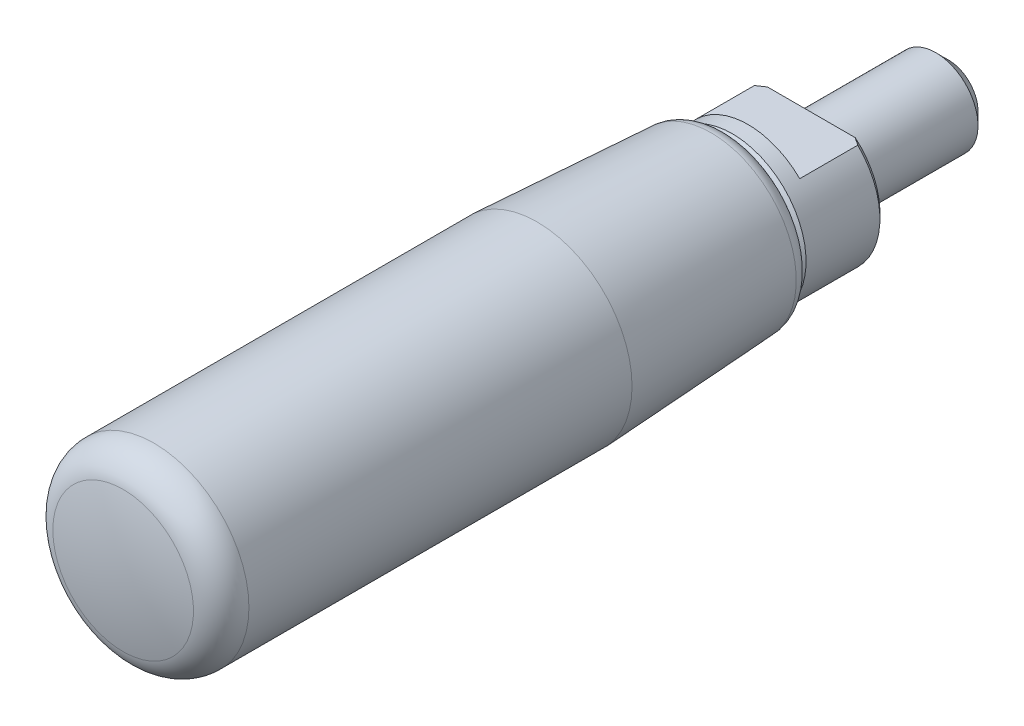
ISO-10303-21;
HEADER;
FILE_DESCRIPTION(('STEP AP214'),'2;1');
FILE_NAME('part.step','',(''),(''),'','','');
FILE_SCHEMA(('AUTOMOTIVE_DESIGN { 1 0 10303 214 1 1 1 1 }'));
ENDSEC;
DATA;
#1=APPLICATION_CONTEXT('core data for automotive mechanical design processes');
#2=APPLICATION_PROTOCOL_DEFINITION('international standard','automotive_design',2000,#1);
#3=PRODUCT_CONTEXT('',#1,'mechanical');
#4=PRODUCT('Part','Part','',(#3));
#5=PRODUCT_RELATED_PRODUCT_CATEGORY('part','',(#4));
#6=PRODUCT_DEFINITION_FORMATION('','',#4);
#7=PRODUCT_DEFINITION_CONTEXT('part definition',#1,'design');
#8=PRODUCT_DEFINITION('design','',#6,#7);
#9=PRODUCT_DEFINITION_SHAPE('','',#8);
#10=(LENGTH_UNIT() NAMED_UNIT(*) SI_UNIT(.MILLI.,.METRE.));
#11=(NAMED_UNIT(*) PLANE_ANGLE_UNIT() SI_UNIT($,.RADIAN.));
#12=(NAMED_UNIT(*) SI_UNIT($,.STERADIAN.) SOLID_ANGLE_UNIT());
#13=UNCERTAINTY_MEASURE_WITH_UNIT(LENGTH_MEASURE(1.E-05),#10,'distance_accuracy_value','');
#14=(GEOMETRIC_REPRESENTATION_CONTEXT(3) GLOBAL_UNCERTAINTY_ASSIGNED_CONTEXT((#13)) GLOBAL_UNIT_ASSIGNED_CONTEXT((#10,
#11,#12)) REPRESENTATION_CONTEXT('',''));
#15=CARTESIAN_POINT('',(0.,0.,0.));
#16=DIRECTION('',(0.,0.,1.));
#17=DIRECTION('',(1.,0.,0.));
#18=AXIS2_PLACEMENT_3D('',#15,#16,#17);
#19=CARTESIAN_POINT('',(0.,4.,0.));
#20=DIRECTION('',(0.,0.,-1.));
#21=DIRECTION('',(-1.,0.,0.));
#22=AXIS2_PLACEMENT_3D('',#19,#20,#21);
#23=PLANE('',#22);
#24=CARTESIAN_POINT('',(0.,0.,0.));
#25=DIRECTION('',(0.,0.,-1.));
#26=DIRECTION('',(-1.,0.,0.));
#27=AXIS2_PLACEMENT_3D('',#24,#25,#26);
#28=CIRCLE('',#27,3.99999999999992);
#29=CARTESIAN_POINT('',(-3.99999999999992,0.,0.));
#30=VERTEX_POINT('',#29);
#31=EDGE_CURVE('E170',#30,#30,#28,.T.);
#32=ORIENTED_EDGE('',*,*,#31,.F.);
#33=EDGE_LOOP('',(#32));
#34=FACE_BOUND('',#33,.T.);
#35=CARTESIAN_POINT('',(0.,0.,0.));
#36=DIRECTION('',(0.,0.,-1.));
#37=DIRECTION('',(-1.,0.,0.));
#38=AXIS2_PLACEMENT_3D('',#35,#36,#37);
#39=CIRCLE('',#38,6.5);
#40=CARTESIAN_POINT('',(4.153311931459,5.,0.));
#41=VERTEX_POINT('',#40);
#42=CARTESIAN_POINT('',(4.153311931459,-5.,0.));
#43=VERTEX_POINT('',#42);
#44=EDGE_CURVE('E139',#41,#43,#39,.T.);
#45=ORIENTED_EDGE('',*,*,#44,.T.);
#46=DIRECTION('',(-1.,0.,0.));
#47=VECTOR('',#46,1.);
#48=CARTESIAN_POINT('',(0.,-5.,0.));
#49=LINE('',#48,#47);
#50=CARTESIAN_POINT('',(-4.153311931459,-5.,0.));
#51=VERTEX_POINT('',#50);
#52=EDGE_CURVE('E79',#43,#51,#49,.T.);
#53=ORIENTED_EDGE('',*,*,#52,.T.);
#54=CARTESIAN_POINT('',(-4.153311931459,5.,0.));
#55=VERTEX_POINT('',#54);
#56=EDGE_CURVE('E37',#51,#55,#39,.T.);
#57=ORIENTED_EDGE('',*,*,#56,.T.);
#58=DIRECTION('',(-1.,0.,0.));
#59=VECTOR('',#58,1.);
#60=CARTESIAN_POINT('',(0.,5.,0.));
#61=LINE('',#60,#59);
#62=EDGE_CURVE('E147',#41,#55,#61,.T.);
#63=ORIENTED_EDGE('',*,*,#62,.F.);
#64=EDGE_LOOP('',(#45,#53,#57,#63));
#65=FACE_BOUND('',#64,.T.);
#66=ADVANCED_FACE('F14',(#34,#65),#23,.T.);
#67=CARTESIAN_POINT('',(0.,0.,-18.));
#68=DIRECTION('',(0.,0.,-1.));
#69=DIRECTION('',(-1.,0.,0.));
#70=AXIS2_PLACEMENT_3D('',#67,#68,#69);
#71=CYLINDRICAL_SURFACE('',#70,7.);
#72=CARTESIAN_POINT('',(0.,0.,7.5));
#73=DIRECTION('',(0.,0.,-1.));
#74=DIRECTION('',(-1.,0.,0.));
#75=AXIS2_PLACEMENT_3D('',#72,#73,#74);
#76=CIRCLE('',#75,7.);
#77=CARTESIAN_POINT('',(-6.99999999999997,0.,7.50000000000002));
#78=VERTEX_POINT('',#77);
#79=EDGE_CURVE('E153',#78,#78,#76,.T.);
#80=ORIENTED_EDGE('',*,*,#79,.T.);
#81=EDGE_LOOP('',(#80));
#82=FACE_BOUND('',#81,.T.);
#83=CARTESIAN_POINT('',(0.,0.,0.5));
#84=DIRECTION('',(0.,0.,-1.));
#85=DIRECTION('',(-1.,0.,0.));
#86=AXIS2_PLACEMENT_3D('',#83,#84,#85);
#87=CIRCLE('',#86,7.);
#88=CARTESIAN_POINT('',(-4.89897948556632,-5.,0.500000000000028));
#89=VERTEX_POINT('',#88);
#90=CARTESIAN_POINT('',(-4.89897948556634,5.,0.500000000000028));
#91=VERTEX_POINT('',#90);
#92=EDGE_CURVE('E146',#89,#91,#87,.T.);
#93=ORIENTED_EDGE('',*,*,#92,.F.);
#94=DIRECTION('',(0.,0.,-1.));
#95=VECTOR('',#94,1.);
#96=CARTESIAN_POINT('',(-4.89897948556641,-5.,-18.));
#97=LINE('',#96,#95);
#98=CARTESIAN_POINT('',(-4.89897948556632,-5.,6.));
#99=VERTEX_POINT('',#98);
#100=EDGE_CURVE('E29',#89,#99,#97,.F.);
#101=ORIENTED_EDGE('',*,*,#100,.T.);
#102=CARTESIAN_POINT('',(0.,0.,6.));
#103=DIRECTION('',(0.,0.,1.));
#104=DIRECTION('',(1.,0.,0.));
#105=AXIS2_PLACEMENT_3D('',#102,#103,#104);
#106=CIRCLE('',#105,7.);
#107=CARTESIAN_POINT('',(4.89897948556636,-5.,6.));
#108=VERTEX_POINT('',#107);
#109=EDGE_CURVE('E83',#108,#99,#106,.F.);
#110=ORIENTED_EDGE('',*,*,#109,.F.);
#111=DIRECTION('',(0.,0.,-1.));
#112=VECTOR('',#111,1.);
#113=CARTESIAN_POINT('',(4.89897948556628,-5.,-18.));
#114=LINE('',#113,#112);
#115=CARTESIAN_POINT('',(4.89897948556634,-5.,0.499999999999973));
#116=VERTEX_POINT('',#115);
#117=EDGE_CURVE('E68',#108,#116,#114,.T.);
#118=ORIENTED_EDGE('',*,*,#117,.T.);
#119=CARTESIAN_POINT('',(4.89897948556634,5.,0.499999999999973));
#120=VERTEX_POINT('',#119);
#121=EDGE_CURVE('E151',#120,#116,#87,.T.);
#122=ORIENTED_EDGE('',*,*,#121,.F.);
#123=DIRECTION('',(0.,0.,-1.));
#124=VECTOR('',#123,1.);
#125=CARTESIAN_POINT('',(4.89897948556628,5.,-18.));
#126=LINE('',#125,#124);
#127=CARTESIAN_POINT('',(4.89897948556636,5.,6.));
#128=VERTEX_POINT('',#127);
#129=EDGE_CURVE('E144',#128,#120,#126,.T.);
#130=ORIENTED_EDGE('',*,*,#129,.F.);
#131=CARTESIAN_POINT('',(0.,0.,6.));
#132=DIRECTION('',(0.,0.,-1.));
#133=DIRECTION('',(-1.,0.,0.));
#134=AXIS2_PLACEMENT_3D('',#131,#132,#133);
#135=CIRCLE('',#134,7.);
#136=CARTESIAN_POINT('',(-4.89897948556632,5.,6.));
#137=VERTEX_POINT('',#136);
#138=EDGE_CURVE('E132',#128,#137,#135,.F.);
#139=ORIENTED_EDGE('',*,*,#138,.T.);
#140=DIRECTION('',(0.,0.,-1.));
#141=VECTOR('',#140,1.);
#142=CARTESIAN_POINT('',(-4.89897948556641,5.,-18.));
#143=LINE('',#142,#141);
#144=EDGE_CURVE('E235',#91,#137,#143,.F.);
#145=ORIENTED_EDGE('',*,*,#144,.F.);
#146=EDGE_LOOP('',(#93,#101,#110,#118,#122,#130,#139,#145));
#147=FACE_BOUND('',#146,.T.);
#148=ADVANCED_FACE('F86',(#82,#147),#71,.T.);
#149=CARTESIAN_POINT('',(0.,0.,0.5));
#150=DIRECTION('',(0.,0.,1.));
#151=DIRECTION('',(1.,0.,0.));
#152=AXIS2_PLACEMENT_3D('',#149,#150,#151);
#153=CONICAL_SURFACE('',#152,7.,0.785398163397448);
#154=CARTESIAN_POINT('',(1.49778965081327,-5.,-1.28048145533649));
#155=CARTESIAN_POINT('',(1.60827267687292,-5.,-1.24877770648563));
#156=CARTESIAN_POINT('',(1.71786188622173,-5.,-1.21411111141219));
#157=CARTESIAN_POINT('',(1.93517681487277,-5.,-1.13954248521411));
#158=CARTESIAN_POINT('',(2.04290360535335,-5.,-1.09964358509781));
#159=CARTESIAN_POINT('',(2.3627038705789,-5.,-0.973334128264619));
#160=CARTESIAN_POINT('',(2.57208839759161,-5.,-0.880104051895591));
#161=CARTESIAN_POINT('',(2.98262386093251,-5.,-0.680716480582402));
#162=CARTESIAN_POINT('',(3.18382286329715,-5.,-0.574655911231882));
#163=CARTESIAN_POINT('',(3.58066863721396,-5.,-0.352301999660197));
#164=CARTESIAN_POINT('',(3.77631038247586,-5.,-0.235999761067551));
#165=CARTESIAN_POINT('',(4.23337122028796,-5.,0.0481768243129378));
#166=CARTESIAN_POINT('',(4.49271359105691,-5.,0.219371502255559));
#167=CARTESIAN_POINT('',(5.00450249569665,-5.,0.571825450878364));
#168=CARTESIAN_POINT('',(5.25694692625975,-5.,0.753087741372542));
#169=CARTESIAN_POINT('',(5.75669387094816,-5.,1.1230772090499));
#170=CARTESIAN_POINT('',(6.00399063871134,-5.,1.31181211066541));
#171=CARTESIAN_POINT('',(6.49435370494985,-5.,1.69470566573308));
#172=CARTESIAN_POINT('',(6.73741975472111,-5.,1.88886463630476));
#173=CARTESIAN_POINT('',(7.22537920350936,-5.,2.28552752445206));
#174=CARTESIAN_POINT('',(7.47019951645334,-5.,2.4881211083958));
#175=CARTESIAN_POINT('',(7.95704754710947,-5.,2.89665389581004));
#176=CARTESIAN_POINT('',(8.19907512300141,-5.,3.10259326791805));
#177=CARTESIAN_POINT('',(8.67999186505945,-5.,3.51634917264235));
#178=CARTESIAN_POINT('',(8.91888922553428,-5.,3.72415619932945));
#179=CARTESIAN_POINT('',(9.39479436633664,-5.,4.14186897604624));
#180=CARTESIAN_POINT('',(9.63180236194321,-5.,4.35177448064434));
#181=CARTESIAN_POINT('',(9.8680730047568,-5.,4.5624981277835));
#182=B_SPLINE_CURVE_WITH_KNOTS('',3,(#154,#155,#156,#157,#158,#159,#160,#161,#162,#163,#164,
#165,#166,#167,#168,#169,#170,#171,#172,#173,#174,#175,#176,#177,#178,#179,#180,#181),
.UNSPECIFIED.,.F.,.F.,(4,2,2,2,2,2,2,2,2,2,2,2,2,4),(0.,0.344718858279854,0.68923237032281,
1.37610320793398,2.05807600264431,2.74064714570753,3.67254340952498,4.60472072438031,
5.53788816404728,6.47111027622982,7.42439848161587,8.37773488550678,9.32761684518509,
10.2773889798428),.UNSPECIFIED.);
#183=EDGE_CURVE('E73',#43,#116,#182,.T.);
#184=ORIENTED_EDGE('',*,*,#183,.F.);
#185=ORIENTED_EDGE('',*,*,#44,.F.);
#186=CARTESIAN_POINT('',(1.49778965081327,5.,-1.28048145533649));
#187=CARTESIAN_POINT('',(1.60827267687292,5.,-1.24877770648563));
#188=CARTESIAN_POINT('',(1.71786188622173,5.,-1.21411111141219));
#189=CARTESIAN_POINT('',(1.93517681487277,5.,-1.13954248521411));
#190=CARTESIAN_POINT('',(2.04290360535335,5.,-1.09964358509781));
#191=CARTESIAN_POINT('',(2.3627038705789,5.,-0.973334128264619));
#192=CARTESIAN_POINT('',(2.57208839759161,5.,-0.880104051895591));
#193=CARTESIAN_POINT('',(2.98262386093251,5.,-0.680716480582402));
#194=CARTESIAN_POINT('',(3.18382286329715,5.,-0.574655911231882));
#195=CARTESIAN_POINT('',(3.58066863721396,5.,-0.352301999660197));
#196=CARTESIAN_POINT('',(3.77631038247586,5.,-0.235999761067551));
#197=CARTESIAN_POINT('',(4.23337122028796,5.,0.0481768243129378));
#198=CARTESIAN_POINT('',(4.49271359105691,5.,0.219371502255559));
#199=CARTESIAN_POINT('',(5.00450249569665,5.,0.571825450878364));
#200=CARTESIAN_POINT('',(5.25694692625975,5.,0.753087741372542));
#201=CARTESIAN_POINT('',(5.75669387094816,5.,1.1230772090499));
#202=CARTESIAN_POINT('',(6.00399063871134,5.,1.31181211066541));
#203=CARTESIAN_POINT('',(6.49435370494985,5.,1.69470566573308));
#204=CARTESIAN_POINT('',(6.73741975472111,5.,1.88886463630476));
#205=CARTESIAN_POINT('',(7.22537920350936,5.,2.28552752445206));
#206=CARTESIAN_POINT('',(7.47019951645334,5.,2.4881211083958));
#207=CARTESIAN_POINT('',(7.95704754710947,5.,2.89665389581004));
#208=CARTESIAN_POINT('',(8.19907512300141,5.,3.10259326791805));
#209=CARTESIAN_POINT('',(8.67999186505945,5.,3.51634917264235));
#210=CARTESIAN_POINT('',(8.91888922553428,5.,3.72415619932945));
#211=CARTESIAN_POINT('',(9.39479436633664,5.,4.14186897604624));
#212=CARTESIAN_POINT('',(9.63180236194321,5.,4.35177448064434));
#213=CARTESIAN_POINT('',(9.8680730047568,5.,4.5624981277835));
#214=B_SPLINE_CURVE_WITH_KNOTS('',3,(#186,#187,#188,#189,#190,#191,#192,#193,#194,#195,#196,
#197,#198,#199,#200,#201,#202,#203,#204,#205,#206,#207,#208,#209,#210,#211,#212,#213),
.UNSPECIFIED.,.F.,.F.,(4,2,2,2,2,2,2,2,2,2,2,2,2,4),(0.,0.344718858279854,0.68923237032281,
1.37610320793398,2.05807600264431,2.74064714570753,3.67254340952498,4.60472072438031,
5.53788816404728,6.47111027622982,7.42439848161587,8.37773488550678,9.32761684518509,
10.2773889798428),.UNSPECIFIED.);
#215=EDGE_CURVE('E126',#41,#120,#214,.T.);
#216=ORIENTED_EDGE('',*,*,#215,.T.);
#217=ORIENTED_EDGE('',*,*,#121,.T.);
#218=EDGE_LOOP('',(#184,#185,#216,#217));
#219=FACE_BOUND('',#218,.T.);
#220=ADVANCED_FACE('F103',(#219),#153,.T.);
#221=CARTESIAN_POINT('',(-9.86807300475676,-5.,4.56249812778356));
#222=CARTESIAN_POINT('',(-9.63180236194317,-5.,4.3517744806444));
#223=CARTESIAN_POINT('',(-9.3947943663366,-5.,4.1418689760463));
#224=CARTESIAN_POINT('',(-8.91888922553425,-5.,3.7241561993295));
#225=CARTESIAN_POINT('',(-8.67999186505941,-5.,3.51634917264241));
#226=CARTESIAN_POINT('',(-8.19907512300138,-5.,3.10259326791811));
#227=CARTESIAN_POINT('',(-7.95704754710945,-5.,2.89665389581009));
#228=CARTESIAN_POINT('',(-7.47019951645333,-5.,2.48812110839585));
#229=CARTESIAN_POINT('',(-7.22537920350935,-5.,2.28552752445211));
#230=CARTESIAN_POINT('',(-6.7374197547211,-5.,1.88886463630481));
#231=CARTESIAN_POINT('',(-6.49435370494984,-5.,1.69470566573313));
#232=CARTESIAN_POINT('',(-6.00399063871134,-5.,1.31181211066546));
#233=CARTESIAN_POINT('',(-5.75669387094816,-5.,1.12307720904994));
#234=CARTESIAN_POINT('',(-5.25694692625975,-5.,0.753087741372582));
#235=CARTESIAN_POINT('',(-5.00450249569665,-5.,0.5718254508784));
#236=CARTESIAN_POINT('',(-4.49271359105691,-5.,0.219371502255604));
#237=CARTESIAN_POINT('',(-4.23337122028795,-5.,0.0481768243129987));
#238=CARTESIAN_POINT('',(-3.77631038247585,-5.,-0.2359997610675));
#239=CARTESIAN_POINT('',(-3.58066863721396,-5.,-0.352301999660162));
#240=CARTESIAN_POINT('',(-3.18382286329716,-5.,-0.574655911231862));
#241=CARTESIAN_POINT('',(-2.98262386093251,-5.,-0.68071648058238));
#242=CARTESIAN_POINT('',(-2.57208839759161,-5.,-0.880104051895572));
#243=CARTESIAN_POINT('',(-2.3627038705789,-5.,-0.973334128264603));
#244=CARTESIAN_POINT('',(-2.04290360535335,-5.,-1.0996435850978));
#245=CARTESIAN_POINT('',(-1.93517681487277,-5.,-1.1395424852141));
#246=CARTESIAN_POINT('',(-1.71786188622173,-5.,-1.21411111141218));
#247=CARTESIAN_POINT('',(-1.60827267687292,-5.,-1.24877770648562));
#248=CARTESIAN_POINT('',(-1.49778965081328,-5.,-1.28048145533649));
#249=B_SPLINE_CURVE_WITH_KNOTS('',3,(#221,#222,#223,#224,#225,#226,#227,#228,#229,#230,#231,
#232,#233,#234,#235,#236,#237,#238,#239,#240,#241,#242,#243,#244,#245,#246,#247,#248),
.UNSPECIFIED.,.F.,.F.,(4,2,2,2,2,2,2,2,2,2,2,2,2,4),(0.,0.949772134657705,1.89965409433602,
2.85299049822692,3.80627870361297,4.7395008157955,5.67266825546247,6.6048455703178,
7.53674183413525,8.21931297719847,8.90128577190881,9.58815660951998,9.93267012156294,
10.2773889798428),.UNSPECIFIED.);
#250=EDGE_CURVE('E89',#89,#51,#249,.T.);
#251=ORIENTED_EDGE('',*,*,#250,.F.);
#252=ORIENTED_EDGE('',*,*,#92,.T.);
#253=CARTESIAN_POINT('',(-9.86807300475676,5.,4.56249812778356));
#254=CARTESIAN_POINT('',(-9.63180236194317,5.,4.3517744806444));
#255=CARTESIAN_POINT('',(-9.3947943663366,5.,4.1418689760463));
#256=CARTESIAN_POINT('',(-8.91888922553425,5.,3.7241561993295));
#257=CARTESIAN_POINT('',(-8.67999186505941,5.,3.51634917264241));
#258=CARTESIAN_POINT('',(-8.19907512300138,5.,3.10259326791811));
#259=CARTESIAN_POINT('',(-7.95704754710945,5.,2.89665389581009));
#260=CARTESIAN_POINT('',(-7.47019951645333,5.,2.48812110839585));
#261=CARTESIAN_POINT('',(-7.22537920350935,5.,2.28552752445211));
#262=CARTESIAN_POINT('',(-6.7374197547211,5.,1.88886463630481));
#263=CARTESIAN_POINT('',(-6.49435370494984,5.,1.69470566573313));
#264=CARTESIAN_POINT('',(-6.00399063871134,5.,1.31181211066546));
#265=CARTESIAN_POINT('',(-5.75669387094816,5.,1.12307720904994));
#266=CARTESIAN_POINT('',(-5.25694692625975,5.,0.753087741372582));
#267=CARTESIAN_POINT('',(-5.00450249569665,5.,0.5718254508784));
#268=CARTESIAN_POINT('',(-4.49271359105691,5.,0.219371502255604));
#269=CARTESIAN_POINT('',(-4.23337122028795,5.,0.0481768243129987));
#270=CARTESIAN_POINT('',(-3.77631038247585,5.,-0.2359997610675));
#271=CARTESIAN_POINT('',(-3.58066863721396,5.,-0.352301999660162));
#272=CARTESIAN_POINT('',(-3.18382286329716,5.,-0.574655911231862));
#273=CARTESIAN_POINT('',(-2.98262386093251,5.,-0.68071648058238));
#274=CARTESIAN_POINT('',(-2.57208839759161,5.,-0.880104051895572));
#275=CARTESIAN_POINT('',(-2.3627038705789,5.,-0.973334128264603));
#276=CARTESIAN_POINT('',(-2.04290360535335,5.,-1.0996435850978));
#277=CARTESIAN_POINT('',(-1.93517681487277,5.,-1.1395424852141));
#278=CARTESIAN_POINT('',(-1.71786188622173,5.,-1.21411111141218));
#279=CARTESIAN_POINT('',(-1.60827267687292,5.,-1.24877770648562));
#280=CARTESIAN_POINT('',(-1.49778965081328,5.,-1.28048145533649));
#281=B_SPLINE_CURVE_WITH_KNOTS('',3,(#253,#254,#255,#256,#257,#258,#259,#260,#261,#262,#263,
#264,#265,#266,#267,#268,#269,#270,#271,#272,#273,#274,#275,#276,#277,#278,#279,#280),
.UNSPECIFIED.,.F.,.F.,(4,2,2,2,2,2,2,2,2,2,2,2,2,4),(0.,0.949772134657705,1.89965409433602,
2.85299049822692,3.80627870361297,4.7395008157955,5.67266825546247,6.6048455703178,
7.53674183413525,8.21931297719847,8.90128577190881,9.58815660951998,9.93267012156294,
10.2773889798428),.UNSPECIFIED.);
#282=EDGE_CURVE('E119',#91,#55,#281,.T.);
#283=ORIENTED_EDGE('',*,*,#282,.T.);
#284=ORIENTED_EDGE('',*,*,#56,.F.);
#285=EDGE_LOOP('',(#251,#252,#283,#284));
#286=FACE_BOUND('',#285,.T.);
#287=ADVANCED_FACE('F142',(#286),#153,.T.);
#288=CARTESIAN_POINT('',(0.,0.,-18.));
#289=DIRECTION('',(0.,0.,-1.));
#290=DIRECTION('',(-1.,0.,0.));
#291=AXIS2_PLACEMENT_3D('',#288,#289,#290);
#292=CYLINDRICAL_SURFACE('',#291,4.);
#293=CARTESIAN_POINT('',(0.,0.,-11.8));
#294=DIRECTION('',(0.,0.,-1.));
#295=DIRECTION('',(-1.,0.,0.));
#296=AXIS2_PLACEMENT_3D('',#293,#294,#295);
#297=CIRCLE('',#296,4.);
#298=CARTESIAN_POINT('',(-4.00000000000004,0.,-11.8));
#299=VERTEX_POINT('',#298);
#300=EDGE_CURVE('E9',#299,#299,#297,.F.);
#301=ORIENTED_EDGE('',*,*,#300,.T.);
#302=EDGE_LOOP('',(#301));
#303=FACE_BOUND('',#302,.T.);
#304=ORIENTED_EDGE('',*,*,#31,.T.);
#305=EDGE_LOOP('',(#304));
#306=FACE_BOUND('',#305,.T.);
#307=ADVANCED_FACE('F174',(#303,#306),#292,.T.);
#308=CARTESIAN_POINT('',(0.,0.,-13.));
#309=DIRECTION('',(0.,0.,-1.));
#310=DIRECTION('',(-1.,0.,0.));
#311=AXIS2_PLACEMENT_3D('',#308,#309,#310);
#312=PLANE('',#311);
#313=CARTESIAN_POINT('',(0.,0.,-13.));
#314=DIRECTION('',(0.,0.,-1.));
#315=DIRECTION('',(-1.,0.,0.));
#316=AXIS2_PLACEMENT_3D('',#313,#314,#315);
#317=CIRCLE('',#316,2.8);
#318=CARTESIAN_POINT('',(-2.80000000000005,0.,-13.));
#319=VERTEX_POINT('',#318);
#320=EDGE_CURVE('E22',#319,#319,#317,.T.);
#321=ORIENTED_EDGE('',*,*,#320,.T.);
#322=EDGE_LOOP('',(#321));
#323=FACE_BOUND('',#322,.T.);
#324=ADVANCED_FACE('F186',(#323),#312,.T.);
#325=CARTESIAN_POINT('',(1.30577367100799E-13,0.,36.));
#326=DIRECTION('',(-1.,0.,0.));
#327=DIRECTION('',(0.,0.,1.));
#328=AXIS2_PLACEMENT_3D('',#325,#326,#327);
#329=SPHERICAL_SURFACE('',#328,30.);
#330=CARTESIAN_POINT('',(1.30577367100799E-13,0.,36.));
#331=DIRECTION('',(0.,0.,-1.));
#332=DIRECTION('',(-1.,0.,0.));
#333=AXIS2_PLACEMENT_3D('',#330,#331,#332);
#334=SPHERICAL_SURFACE('',#333,30.);
#335=CARTESIAN_POINT('',(2.36671047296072E-13,0.,65.249881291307));
#336=DIRECTION('',(0.,0.,-1.));
#337=DIRECTION('',(-1.,0.,0.));
#338=AXIS2_PLACEMENT_3D('',#335,#336,#337);
#339=CIRCLE('',#338,6.66666666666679);
#340=CARTESIAN_POINT('',(-6.66666666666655,0.,65.249881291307));
#341=VERTEX_POINT('',#340);
#342=EDGE_CURVE('E168',#341,#341,#339,.T.);
#343=ORIENTED_EDGE('',*,*,#342,.F.);
#344=EDGE_LOOP('',(#343));
#345=FACE_BOUND('',#344,.T.);
#346=ADVANCED_FACE('F190',(#345),#334,.T.);
#347=CARTESIAN_POINT('',(2.26061679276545E-13,0.,62.3248931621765));
#348=DIRECTION('',(0.,0.,-1.));
#349=DIRECTION('',(-1.,0.,0.));
#350=AXIS2_PLACEMENT_3D('',#347,#348,#349);
#351=TOROIDAL_SURFACE('',#350,6.00000000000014,3.);
#352=CARTESIAN_POINT('',(2.26061679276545E-13,0.,62.3248931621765));
#353=DIRECTION('',(0.,0.,-1.));
#354=DIRECTION('',(-1.,0.,0.));
#355=AXIS2_PLACEMENT_3D('',#352,#353,#354);
#356=CIRCLE('',#355,9.00000000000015);
#357=CARTESIAN_POINT('',(-8.99999999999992,0.,62.3248931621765));
#358=VERTEX_POINT('',#357);
#359=EDGE_CURVE('E165',#358,#358,#356,.T.);
#360=ORIENTED_EDGE('',*,*,#359,.F.);
#361=EDGE_LOOP('',(#360));
#362=FACE_BOUND('',#361,.T.);
#363=ORIENTED_EDGE('',*,*,#342,.T.);
#364=EDGE_LOOP('',(#363));
#365=FACE_BOUND('',#364,.T.);
#366=ADVANCED_FACE('F194',(#362,#365),#351,.T.);
#367=CARTESIAN_POINT('',(0.,0.,-18.));
#368=DIRECTION('',(0.,0.,-1.));
#369=DIRECTION('',(-1.,0.,0.));
#370=AXIS2_PLACEMENT_3D('',#367,#368,#369);
#371=CYLINDRICAL_SURFACE('',#370,9.00000000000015);
#372=CARTESIAN_POINT('',(0.,0.,26.));
#373=DIRECTION('',(0.,0.,-1.));
#374=DIRECTION('',(-1.,0.,0.));
#375=AXIS2_PLACEMENT_3D('',#372,#373,#374);
#376=CIRCLE('',#375,9.00000000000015);
#377=CARTESIAN_POINT('',(-9.00000000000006,0.,26.));
#378=VERTEX_POINT('',#377);
#379=EDGE_CURVE('E162',#378,#378,#376,.T.);
#380=ORIENTED_EDGE('',*,*,#379,.F.);
#381=EDGE_LOOP('',(#380));
#382=FACE_BOUND('',#381,.T.);
#383=ORIENTED_EDGE('',*,*,#359,.T.);
#384=EDGE_LOOP('',(#383));
#385=FACE_BOUND('',#384,.T.);
#386=ADVANCED_FACE('F198',(#382,#385),#371,.T.);
#387=CARTESIAN_POINT('',(0.,0.,26.));
#388=DIRECTION('',(0.,0.,1.));
#389=DIRECTION('',(1.,0.,0.));
#390=AXIS2_PLACEMENT_3D('',#387,#388,#389);
#391=CONICAL_SURFACE('',#390,9.00000000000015,0.0554985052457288);
#392=CARTESIAN_POINT('',(0.,0.,9.511247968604));
#393=DIRECTION('',(0.,0.,-1.));
#394=DIRECTION('',(-1.,0.,0.));
#395=AXIS2_PLACEMENT_3D('',#392,#393,#394);
#396=CIRCLE('',#395,8.08395822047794);
#397=CARTESIAN_POINT('',(-8.08395822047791,0.,9.51124796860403));
#398=VERTEX_POINT('',#397);
#399=EDGE_CURVE('E159',#398,#398,#396,.T.);
#400=ORIENTED_EDGE('',*,*,#399,.F.);
#401=EDGE_LOOP('',(#400));
#402=FACE_BOUND('',#401,.T.);
#403=ORIENTED_EDGE('',*,*,#379,.T.);
#404=EDGE_LOOP('',(#403));
#405=FACE_BOUND('',#404,.T.);
#406=ADVANCED_FACE('F202',(#402,#405),#391,.T.);
#407=CARTESIAN_POINT('',(0.,0.,9.6));
#408=DIRECTION('',(0.,0.,-1.));
#409=DIRECTION('',(-1.,0.,0.));
#410=AXIS2_PLACEMENT_3D('',#407,#408,#409);
#411=TOROIDAL_SURFACE('',#410,6.4864216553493,1.6);
#412=CARTESIAN_POINT('',(0.,0.,8.00005713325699));
#413=DIRECTION('',(0.,0.,-1.));
#414=DIRECTION('',(-1.,0.,0.));
#415=AXIS2_PLACEMENT_3D('',#412,#413,#414);
#416=CIRCLE('',#415,6.49994286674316);
#417=CARTESIAN_POINT('',(-6.49994286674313,0.,8.00005713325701));
#418=VERTEX_POINT('',#417);
#419=EDGE_CURVE('E156',#418,#418,#416,.T.);
#420=ORIENTED_EDGE('',*,*,#419,.F.);
#421=EDGE_LOOP('',(#420));
#422=FACE_BOUND('',#421,.T.);
#423=ORIENTED_EDGE('',*,*,#399,.T.);
#424=EDGE_LOOP('',(#423));
#425=FACE_BOUND('',#424,.T.);
#426=ADVANCED_FACE('F206',(#422,#425),#411,.T.);
#427=CARTESIAN_POINT('',(0.,0.,7.5));
#428=DIRECTION('',(0.,0.,-1.));
#429=DIRECTION('',(-1.,0.,0.));
#430=AXIS2_PLACEMENT_3D('',#427,#428,#429);
#431=CONICAL_SURFACE('',#430,7.,0.785398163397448);
#432=ORIENTED_EDGE('',*,*,#419,.T.);
#433=EDGE_LOOP('',(#432));
#434=FACE_BOUND('',#433,.T.);
#435=ORIENTED_EDGE('',*,*,#79,.F.);
#436=EDGE_LOOP('',(#435));
#437=FACE_BOUND('',#436,.T.);
#438=ADVANCED_FACE('F210',(#434,#437),#431,.T.);
#439=CARTESIAN_POINT('',(5.,9.22699355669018,6.));
#440=DIRECTION('',(0.,0.,-1.));
#441=DIRECTION('',(-1.,0.,0.));
#442=AXIS2_PLACEMENT_3D('',#439,#440,#441);
#443=PLANE('',#442);
#444=DIRECTION('',(-1.,0.,0.));
#445=VECTOR('',#444,1.);
#446=CARTESIAN_POINT('',(5.,5.,6.));
#447=LINE('',#446,#445);
#448=EDGE_CURVE('E78',#128,#137,#447,.T.);
#449=ORIENTED_EDGE('',*,*,#448,.T.);
#450=ORIENTED_EDGE('',*,*,#138,.F.);
#451=EDGE_LOOP('',(#449,#450));
#452=FACE_BOUND('',#451,.T.);
#453=ADVANCED_FACE('F115',(#452),#443,.T.);
#454=CARTESIAN_POINT('',(5.,5.,-1.38314277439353));
#455=DIRECTION('',(0.,-1.,0.));
#456=DIRECTION('',(1.,0.,0.));
#457=AXIS2_PLACEMENT_3D('',#454,#455,#456);
#458=PLANE('',#457);
#459=ORIENTED_EDGE('',*,*,#129,.T.);
#460=ORIENTED_EDGE('',*,*,#215,.F.);
#461=ORIENTED_EDGE('',*,*,#62,.T.);
#462=ORIENTED_EDGE('',*,*,#282,.F.);
#463=ORIENTED_EDGE('',*,*,#144,.T.);
#464=ORIENTED_EDGE('',*,*,#448,.F.);
#465=EDGE_LOOP('',(#459,#460,#461,#462,#463,#464));
#466=FACE_BOUND('',#465,.T.);
#467=ADVANCED_FACE('F111',(#466),#458,.F.);
#468=CARTESIAN_POINT('',(5.,-5.,-1.38314277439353));
#469=DIRECTION('',(0.,-1.,0.));
#470=DIRECTION('',(1.,0.,0.));
#471=AXIS2_PLACEMENT_3D('',#468,#469,#470);
#472=PLANE('',#471);
#473=DIRECTION('',(-1.,0.,0.));
#474=VECTOR('',#473,1.);
#475=CARTESIAN_POINT('',(5.,-5.,6.));
#476=LINE('',#475,#474);
#477=EDGE_CURVE('E71',#108,#99,#476,.T.);
#478=ORIENTED_EDGE('',*,*,#477,.T.);
#479=ORIENTED_EDGE('',*,*,#100,.F.);
#480=ORIENTED_EDGE('',*,*,#250,.T.);
#481=ORIENTED_EDGE('',*,*,#52,.F.);
#482=ORIENTED_EDGE('',*,*,#183,.T.);
#483=ORIENTED_EDGE('',*,*,#117,.F.);
#484=EDGE_LOOP('',(#478,#479,#480,#481,#482,#483));
#485=FACE_BOUND('',#484,.T.);
#486=ADVANCED_FACE('F70',(#485),#472,.T.);
#487=CARTESIAN_POINT('',(5.,-9.22699355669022,6.));
#488=DIRECTION('',(0.,0.,1.));
#489=DIRECTION('',(1.,0.,0.));
#490=AXIS2_PLACEMENT_3D('',#487,#488,#489);
#491=PLANE('',#490);
#492=ORIENTED_EDGE('',*,*,#109,.T.);
#493=ORIENTED_EDGE('',*,*,#477,.F.);
#494=EDGE_LOOP('',(#492,#493));
#495=FACE_BOUND('',#494,.T.);
#496=ADVANCED_FACE('F82',(#495),#491,.F.);
#497=CARTESIAN_POINT('',(0.,0.,-13.));
#498=DIRECTION('',(0.,0.,1.));
#499=DIRECTION('',(1.,0.,0.));
#500=AXIS2_PLACEMENT_3D('',#497,#498,#499);
#501=CONICAL_SURFACE('',#500,2.8,0.78539816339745);
#502=ORIENTED_EDGE('',*,*,#300,.F.);
#503=EDGE_LOOP('',(#502));
#504=FACE_BOUND('',#503,.T.);
#505=ORIENTED_EDGE('',*,*,#320,.F.);
#506=EDGE_LOOP('',(#505));
#507=FACE_BOUND('',#506,.T.);
#508=ADVANCED_FACE('F16',(#504,#507),#501,.T.);
#509=CLOSED_SHELL('',(#66,#148,#220,#287,#307,#324,#346,#366,#386,#406,#426,#438,#453,#467,#486,
#496,#508));
#510=MANIFOLD_SOLID_BREP('B1',#509);
#511=ADVANCED_BREP_SHAPE_REPRESENTATION('',(#18,#510),#14);
#512=SHAPE_DEFINITION_REPRESENTATION(#9,#511);
ENDSEC;
END-ISO-10303-21;
